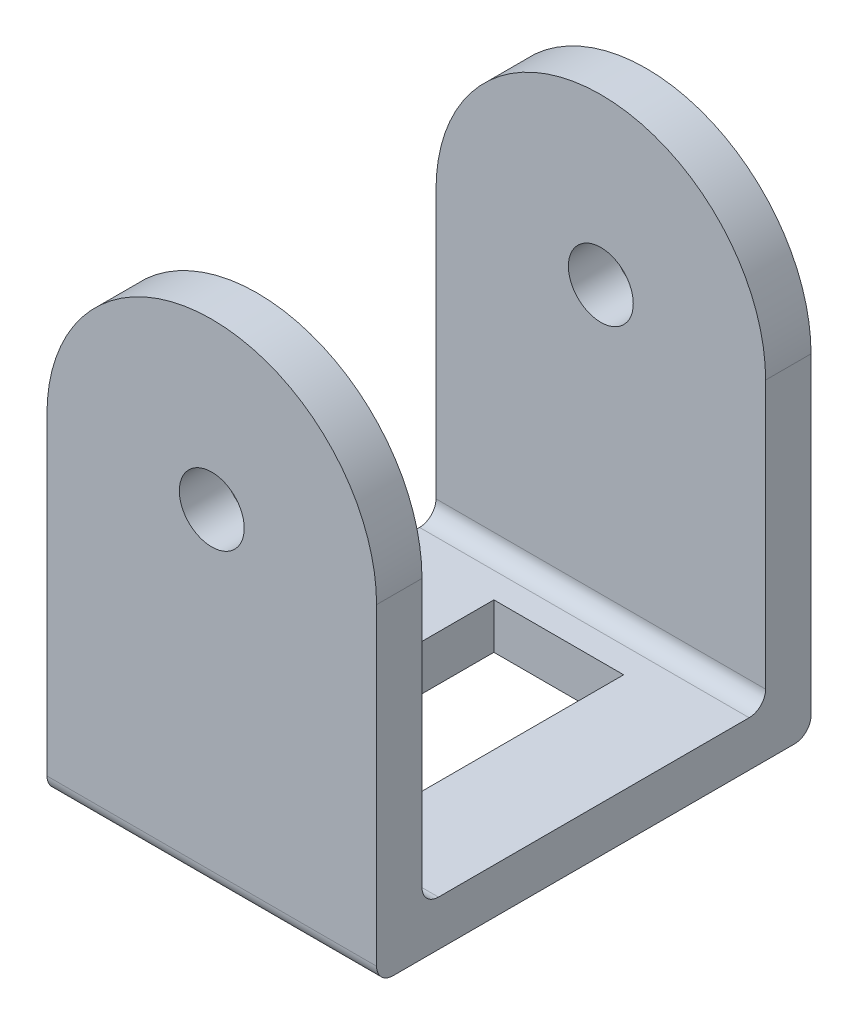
from build123d import *

# Parameters (mm, degrees)
SKETCH1_W           = 50.8
SKETCH1_H           = 66.96
BOSS_EXTRUDE1_DEPTH = 7
SKETCH2_W           = 20
SKETCH2_H           = 40
CUT_EXTRUDE1_DEPTH  = 7
SKETCH3_W           = 50.8
SKETCH3_H           = 7
BOSS_EXTRUDE2_DEPTH = 69.2
FILLET2_RADIUS      = 25.4
FILLET2_LENGTH      = 7
FILLET3_RADIUS      = 25.4
FILLET3_LENGTH      = 7
SKETCH4_R           = 5
CUT_EXTRUDE2_DEPTH  = 400
FILLET5_R           = 2.54


with BuildPart() as part:
    # Sketch1 → Boss-Extrude1 (new body)
    with BuildSketch(Plane(origin=(0, 0, 0), x_dir=(1, 0, 0), z_dir=(0, 1, 0))):
        Rectangle(SKETCH1_W, SKETCH1_H)
    extrude(amount=BOSS_EXTRUDE1_DEPTH)

    # Sketch2 → Cut-Extrude1 (cut)
    with BuildSketch(Plane(origin=(0, 7, 0), x_dir=(1, 0, 0), z_dir=(0, 1, 0))):
        Rectangle(SKETCH2_W, SKETCH2_H)
    extrude(amount=-CUT_EXTRUDE1_DEPTH, mode=Mode.SUBTRACT)

    # Sketch3 → Boss-Extrude2 (add)
    with BuildSketch(Plane(origin=(0, 7, 0), x_dir=(1, 0, 0), z_dir=(0, 1, 0))):
        with Locations((0, 29.98)):
            Rectangle(SKETCH3_W, SKETCH3_H)
        with Locations((0, -29.98)):
            Rectangle(SKETCH3_W, SKETCH3_H)
    extrude(amount=BOSS_EXTRUDE2_DEPTH)

    # Fillet2: full round fillet: the end face becomes a half cylinder, R = half its width
    fillet2_face = Plane((0, 76.2, -29.98), x_dir=(0, 0, 1), z_dir=(0, 1, 0))  # on the end face: x along it, z out of the body
    fillet2_slab = fillet2_face.offset(-FILLET2_RADIUS / 2) * Box(FILLET2_LENGTH, 2 * FILLET2_RADIUS, FILLET2_RADIUS, mode=Mode.PRIVATE)  # the body's end, R deep
    fillet2_round = Plane((0, 50.8, -29.98), x_dir=(0, 1, 0), z_dir=(0, 0, 1)) * Cylinder(FILLET2_RADIUS, FILLET2_LENGTH, mode=Mode.PRIVATE)  # its axis R under the face
    add(fillet2_slab - fillet2_round, mode=Mode.SUBTRACT)

    # Fillet3: full round fillet: the end face becomes a half cylinder, R = half its width
    fillet3_face = Plane((0, 76.2, 29.98), x_dir=(0, 0, -1), z_dir=(0, 1, 0))  # on the end face: x along it, z out of the body
    fillet3_slab = fillet3_face.offset(-FILLET3_RADIUS / 2) * Box(FILLET3_LENGTH, 2 * FILLET3_RADIUS, FILLET3_RADIUS, mode=Mode.PRIVATE)  # the body's end, R deep
    fillet3_round = Plane((0, 50.8, 29.98), x_dir=(0, 1, 0), z_dir=(0, 0, -1)) * Cylinder(FILLET3_RADIUS, FILLET3_LENGTH, mode=Mode.PRIVATE)  # its axis R under the face
    add(fillet3_slab - fillet3_round, mode=Mode.SUBTRACT)

    # Sketch4 → Cut-Extrude2 (cut, symmetric)
    with BuildSketch(Plane.XY.offset(-26.48)):
        with Locations((0, 50.8)):
            Circle(SKETCH4_R)
    extrude(amount=CUT_EXTRUDE2_DEPTH, both=True, mode=Mode.SUBTRACT)

    # Fillet5
    fillet5_edges = [part.edges().sort_by_distance(p)[0] for p in [
        (0, 7, -26.48),
        (0, 7, 26.48),
        (0, 0, -33.48),
        (0, 0, 33.48),
    ]]
    fillet(fillet5_edges, radius=FILLET5_R)


solid = part.part
